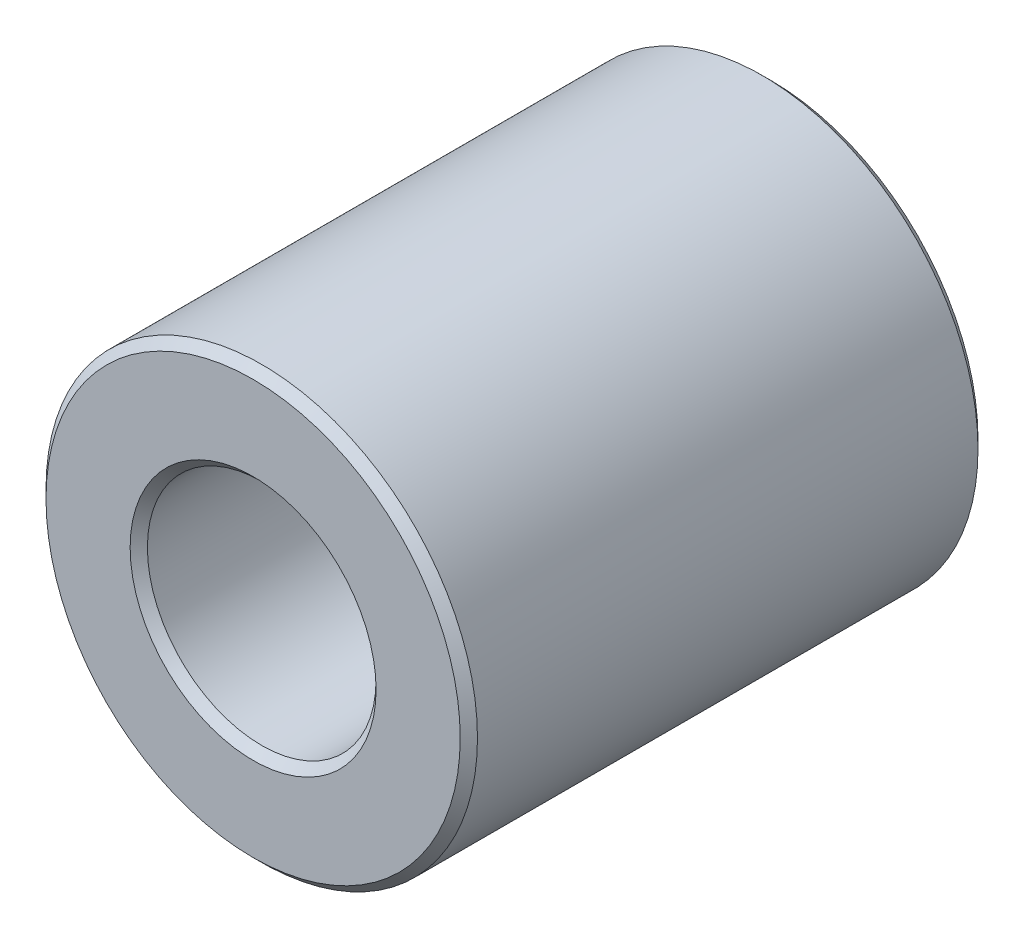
ISO-10303-21;
HEADER;
FILE_DESCRIPTION(('STEP AP214'),'2;1');
FILE_NAME('part.step','',(''),(''),'','','');
FILE_SCHEMA(('AUTOMOTIVE_DESIGN { 1 0 10303 214 1 1 1 1 }'));
ENDSEC;
DATA;
#1=APPLICATION_CONTEXT('core data for automotive mechanical design processes');
#2=APPLICATION_PROTOCOL_DEFINITION('international standard','automotive_design',2000,#1);
#3=PRODUCT_CONTEXT('',#1,'mechanical');
#4=PRODUCT('Part','Part','',(#3));
#5=PRODUCT_RELATED_PRODUCT_CATEGORY('part','',(#4));
#6=PRODUCT_DEFINITION_FORMATION('','',#4);
#7=PRODUCT_DEFINITION_CONTEXT('part definition',#1,'design');
#8=PRODUCT_DEFINITION('design','',#6,#7);
#9=PRODUCT_DEFINITION_SHAPE('','',#8);
#10=(LENGTH_UNIT() NAMED_UNIT(*) SI_UNIT(.MILLI.,.METRE.));
#11=(NAMED_UNIT(*) PLANE_ANGLE_UNIT() SI_UNIT($,.RADIAN.));
#12=(NAMED_UNIT(*) SI_UNIT($,.STERADIAN.) SOLID_ANGLE_UNIT());
#13=UNCERTAINTY_MEASURE_WITH_UNIT(LENGTH_MEASURE(1.E-05),#10,'distance_accuracy_value','');
#14=(GEOMETRIC_REPRESENTATION_CONTEXT(3) GLOBAL_UNCERTAINTY_ASSIGNED_CONTEXT((#13)) GLOBAL_UNIT_ASSIGNED_CONTEXT((#10,
#11,#12)) REPRESENTATION_CONTEXT('',''));
#15=CARTESIAN_POINT('',(0.,0.,0.));
#16=DIRECTION('',(0.,0.,1.));
#17=DIRECTION('',(1.,0.,0.));
#18=AXIS2_PLACEMENT_3D('',#15,#16,#17);
#19=CARTESIAN_POINT('',(0.,0.,6.));
#20=DIRECTION('',(0.,0.,1.));
#21=DIRECTION('',(1.,0.,0.));
#22=AXIS2_PLACEMENT_3D('',#19,#20,#21);
#23=PLANE('',#22);
#24=CARTESIAN_POINT('',(0.,0.,6.));
#25=DIRECTION('',(0.,0.,1.));
#26=DIRECTION('',(1.,0.,0.));
#27=AXIS2_PLACEMENT_3D('',#24,#25,#26);
#28=CIRCLE('',#27,2.85);
#29=CARTESIAN_POINT('',(2.85,0.,6.));
#30=VERTEX_POINT('',#29);
#31=EDGE_CURVE('E10',#30,#30,#28,.F.);
#32=ORIENTED_EDGE('',*,*,#31,.T.);
#33=EDGE_LOOP('',(#32));
#34=FACE_BOUND('',#33,.T.);
#35=CARTESIAN_POINT('',(0.,0.,6.));
#36=DIRECTION('',(0.,0.,1.));
#37=DIRECTION('',(1.,0.,0.));
#38=AXIS2_PLACEMENT_3D('',#35,#36,#37);
#39=CIRCLE('',#38,4.80000000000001);
#40=CARTESIAN_POINT('',(4.80000000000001,0.,6.));
#41=VERTEX_POINT('',#40);
#42=EDGE_CURVE('E45',#41,#41,#39,.T.);
#43=ORIENTED_EDGE('',*,*,#42,.T.);
#44=EDGE_LOOP('',(#43));
#45=FACE_BOUND('',#44,.T.);
#46=ADVANCED_FACE('F37',(#34,#45),#23,.T.);
#47=CARTESIAN_POINT('',(0.,0.,-6.));
#48=DIRECTION('',(0.,0.,1.));
#49=DIRECTION('',(1.,0.,0.));
#50=AXIS2_PLACEMENT_3D('',#47,#48,#49);
#51=PLANE('',#50);
#52=CARTESIAN_POINT('',(0.,0.,-6.));
#53=DIRECTION('',(0.,0.,1.));
#54=DIRECTION('',(1.,0.,0.));
#55=AXIS2_PLACEMENT_3D('',#52,#53,#54);
#56=CIRCLE('',#55,4.8);
#57=CARTESIAN_POINT('',(4.8,0.,-6.));
#58=VERTEX_POINT('',#57);
#59=EDGE_CURVE('E62',#58,#58,#56,.F.);
#60=ORIENTED_EDGE('',*,*,#59,.T.);
#61=EDGE_LOOP('',(#60));
#62=FACE_BOUND('',#61,.T.);
#63=CARTESIAN_POINT('',(0.,0.,-6.));
#64=DIRECTION('',(0.,0.,1.));
#65=DIRECTION('',(1.,0.,0.));
#66=AXIS2_PLACEMENT_3D('',#63,#64,#65);
#67=CIRCLE('',#66,2.85);
#68=CARTESIAN_POINT('',(2.85,0.,-6.));
#69=VERTEX_POINT('',#68);
#70=EDGE_CURVE('E66',#69,#69,#67,.T.);
#71=ORIENTED_EDGE('',*,*,#70,.T.);
#72=EDGE_LOOP('',(#71));
#73=FACE_BOUND('',#72,.T.);
#74=ADVANCED_FACE('F89',(#62,#73),#51,.F.);
#75=CARTESIAN_POINT('',(0.,0.,6.));
#76=DIRECTION('',(0.,0.,-1.));
#77=DIRECTION('',(-1.,0.,0.));
#78=AXIS2_PLACEMENT_3D('',#75,#76,#77);
#79=CYLINDRICAL_SURFACE('',#78,5.);
#80=CARTESIAN_POINT('',(0.,0.,-5.80000000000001));
#81=DIRECTION('',(0.,0.,1.));
#82=DIRECTION('',(1.,0.,0.));
#83=AXIS2_PLACEMENT_3D('',#80,#81,#82);
#84=CIRCLE('',#83,5.);
#85=CARTESIAN_POINT('',(5.,0.,-5.80000000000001));
#86=VERTEX_POINT('',#85);
#87=EDGE_CURVE('E70',#86,#86,#84,.T.);
#88=ORIENTED_EDGE('',*,*,#87,.T.);
#89=EDGE_LOOP('',(#88));
#90=FACE_BOUND('',#89,.T.);
#91=CARTESIAN_POINT('',(0.,0.,5.8));
#92=DIRECTION('',(0.,0.,1.));
#93=DIRECTION('',(1.,0.,0.));
#94=AXIS2_PLACEMENT_3D('',#91,#92,#93);
#95=CIRCLE('',#94,5.);
#96=CARTESIAN_POINT('',(5.,0.,5.8));
#97=VERTEX_POINT('',#96);
#98=EDGE_CURVE('E73',#97,#97,#95,.F.);
#99=ORIENTED_EDGE('',*,*,#98,.T.);
#100=EDGE_LOOP('',(#99));
#101=FACE_BOUND('',#100,.T.);
#102=ADVANCED_FACE('F78',(#90,#101),#79,.T.);
#103=CARTESIAN_POINT('',(0.,0.,6.));
#104=DIRECTION('',(0.,0.,-1.));
#105=DIRECTION('',(-1.,0.,0.));
#106=AXIS2_PLACEMENT_3D('',#103,#104,#105);
#107=CYLINDRICAL_SURFACE('',#106,2.65);
#108=CARTESIAN_POINT('',(0.,0.,-5.8));
#109=DIRECTION('',(0.,0.,1.));
#110=DIRECTION('',(1.,0.,0.));
#111=AXIS2_PLACEMENT_3D('',#108,#109,#110);
#112=CIRCLE('',#111,2.65);
#113=CARTESIAN_POINT('',(2.65,0.,-5.8));
#114=VERTEX_POINT('',#113);
#115=EDGE_CURVE('E51',#114,#114,#112,.F.);
#116=ORIENTED_EDGE('',*,*,#115,.T.);
#117=EDGE_LOOP('',(#116));
#118=FACE_BOUND('',#117,.T.);
#119=CARTESIAN_POINT('',(0.,0.,5.8));
#120=DIRECTION('',(0.,0.,1.));
#121=DIRECTION('',(1.,0.,0.));
#122=AXIS2_PLACEMENT_3D('',#119,#120,#121);
#123=CIRCLE('',#122,2.65);
#124=CARTESIAN_POINT('',(2.65,0.,5.8));
#125=VERTEX_POINT('',#124);
#126=EDGE_CURVE('E56',#125,#125,#123,.T.);
#127=ORIENTED_EDGE('',*,*,#126,.T.);
#128=EDGE_LOOP('',(#127));
#129=FACE_BOUND('',#128,.T.);
#130=ADVANCED_FACE('F97',(#118,#129),#107,.F.);
#131=CARTESIAN_POINT('',(0.,0.,-5.80000000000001));
#132=DIRECTION('',(0.,0.,1.));
#133=DIRECTION('',(1.,0.,0.));
#134=AXIS2_PLACEMENT_3D('',#131,#132,#133);
#135=CONICAL_SURFACE('',#134,5.,0.785398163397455);
#136=ORIENTED_EDGE('',*,*,#59,.F.);
#137=EDGE_LOOP('',(#136));
#138=FACE_BOUND('',#137,.T.);
#139=ORIENTED_EDGE('',*,*,#87,.F.);
#140=EDGE_LOOP('',(#139));
#141=FACE_BOUND('',#140,.T.);
#142=ADVANCED_FACE('F102',(#138,#141),#135,.T.);
#143=CARTESIAN_POINT('',(0.,0.,-6.));
#144=DIRECTION('',(0.,0.,-1.));
#145=DIRECTION('',(-1.,0.,0.));
#146=AXIS2_PLACEMENT_3D('',#143,#144,#145);
#147=CONICAL_SURFACE('',#146,2.85,0.785398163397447);
#148=ORIENTED_EDGE('',*,*,#115,.F.);
#149=EDGE_LOOP('',(#148));
#150=FACE_BOUND('',#149,.T.);
#151=ORIENTED_EDGE('',*,*,#70,.F.);
#152=EDGE_LOOP('',(#151));
#153=FACE_BOUND('',#152,.T.);
#154=ADVANCED_FACE('F86',(#150,#153),#147,.F.);
#155=CARTESIAN_POINT('',(0.,0.,5.8));
#156=DIRECTION('',(0.,0.,1.));
#157=DIRECTION('',(1.,0.,0.));
#158=AXIS2_PLACEMENT_3D('',#155,#156,#157);
#159=CONICAL_SURFACE('',#158,2.65,0.785398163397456);
#160=ORIENTED_EDGE('',*,*,#31,.F.);
#161=EDGE_LOOP('',(#160));
#162=FACE_BOUND('',#161,.T.);
#163=ORIENTED_EDGE('',*,*,#126,.F.);
#164=EDGE_LOOP('',(#163));
#165=FACE_BOUND('',#164,.T.);
#166=ADVANCED_FACE('F82',(#162,#165),#159,.F.);
#167=CARTESIAN_POINT('',(0.,0.,6.));
#168=DIRECTION('',(0.,0.,-1.));
#169=DIRECTION('',(-1.,0.,0.));
#170=AXIS2_PLACEMENT_3D('',#167,#168,#169);
#171=CONICAL_SURFACE('',#170,4.80000000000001,0.785398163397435);
#172=ORIENTED_EDGE('',*,*,#98,.F.);
#173=EDGE_LOOP('',(#172));
#174=FACE_BOUND('',#173,.T.);
#175=ORIENTED_EDGE('',*,*,#42,.F.);
#176=EDGE_LOOP('',(#175));
#177=FACE_BOUND('',#176,.T.);
#178=ADVANCED_FACE('F39',(#174,#177),#171,.T.);
#179=CLOSED_SHELL('',(#46,#74,#102,#130,#142,#154,#166,#178));
#180=MANIFOLD_SOLID_BREP('B2',#179);
#181=ADVANCED_BREP_SHAPE_REPRESENTATION('',(#18,#180),#14);
#182=SHAPE_DEFINITION_REPRESENTATION(#9,#181);
ENDSEC;
END-ISO-10303-21;
